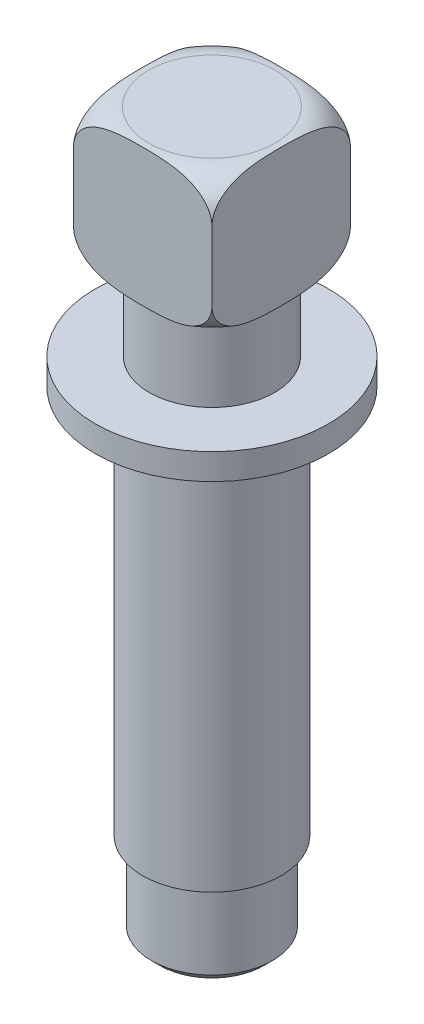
from build123d import *

# Parameters (mm, degrees)
SKETCH1_W      = 16
SKETCH1_H      = 16
EXTRUDE1_DEPTH = 16
CHAMFER1_SIZE  = 1


with BuildPart() as part:
    # Sketch1 → Extrude1 (new body)
    with BuildSketch(Plane(origin=(0, 0, 0), x_dir=(1, 0, 0), z_dir=(0, 1, 0))):
        Rectangle(SKETCH1_W, SKETCH1_H)
    extrude(amount=EXTRUDE1_DEPTH)

    # Sketch2 → Cut-Revolve1 (revolve, cut)
    with BuildSketch(Plane(origin=(0, 0, 0), x_dir=(-0.7071067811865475, 0, 0.7071067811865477), z_dir=(-0.7071067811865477, 0, -0.7071067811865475)), mode=Mode.PRIVATE) as cut_revolve1_sk:
        with BuildLine():
            Line((7.313708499, 16), (7.313708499, 17.605989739))
            Line((7.313708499, 17.605989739), (12.450321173, 17.605989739))
            Line((12.450321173, 17.605989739), (12.450321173, 12))
            Line((12.450321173, 12), (11.313708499, 12))
            ThreePointArc((11.313708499, 12), (10.142135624, 14.828427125), (7.313708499, 16))
        make_face()
        with BuildLine():
            Line((12.450321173, 4), (11.313708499, 4))
            ThreePointArc((11.313708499, 4), (10.142135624, 1.171572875), (7.313708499, 0))
            Line((7.313708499, 0), (7.313708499, -1.605989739))
            Line((7.313708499, -1.605989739), (12.450321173, -1.605989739))
            Line((12.450321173, -1.605989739), (12.450321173, 4))
        make_face()
    revolve(cut_revolve1_sk.sketch.rotate(Axis((0, 0, 0), (0, 1, 0)), 45), axis=Axis((0, 0, 0), (0, 1, 0)), mode=Mode.SUBTRACT)

    # Sketch3 → Revolve1 (revolve)
    with BuildSketch(Plane.XY, mode=Mode.PRIVATE) as revolve1_sk:
        Polygon((0, 0), (7.25, 0), (7.25, -9), (13.5, -9), (13.5, -12), (8, -12), (8, -57), (7, -57), (7, -67), (0, -67), align=None)
    revolve(revolve1_sk.sketch.rotate(Axis((0, 0, 0), (0, -1, 0)), 90), axis=Axis((0, 0, 0), (0, -1, 0)))

    # Chamfer1
    chamfer1_edges = [part.edges().sort_by_distance(p)[0] for p in [
        (0, -67, -7),
    ]]
    chamfer(chamfer1_edges, length=CHAMFER1_SIZE)


solid = part.part
